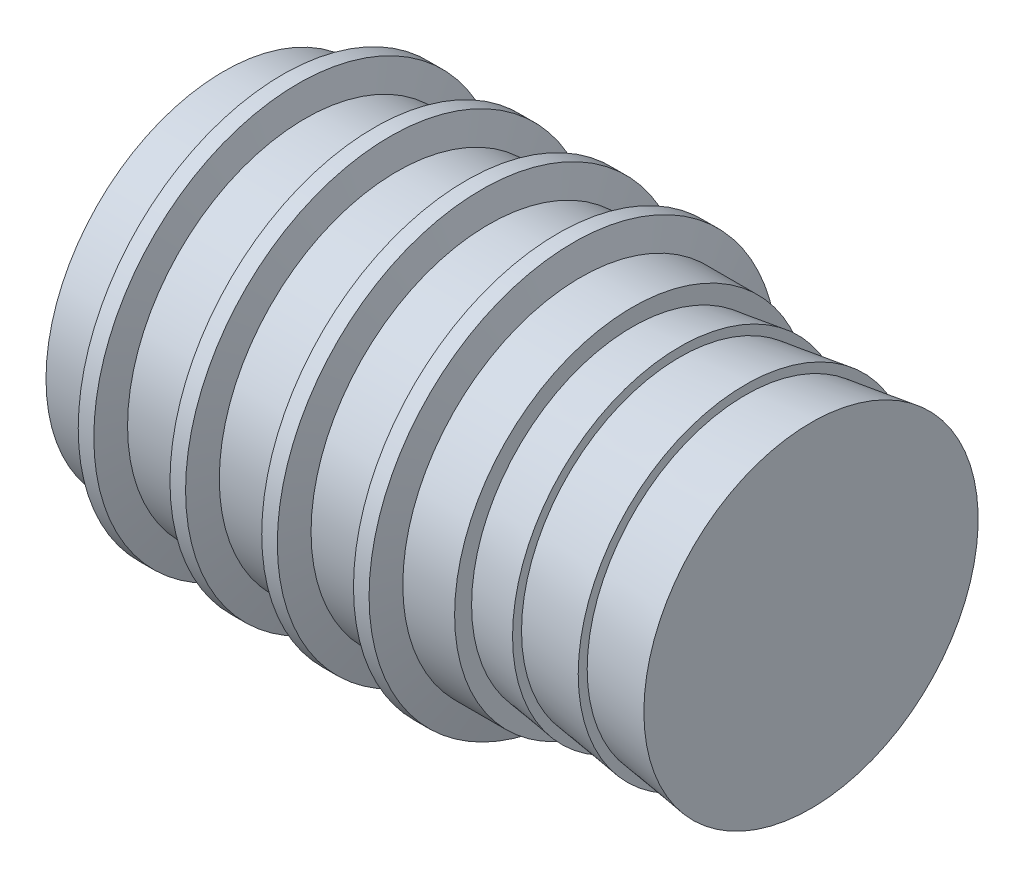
ISO-10303-21;
HEADER;
FILE_DESCRIPTION(('STEP AP214'),'2;1');
FILE_NAME('part.step','',(''),(''),'','','');
FILE_SCHEMA(('AUTOMOTIVE_DESIGN { 1 0 10303 214 1 1 1 1 }'));
ENDSEC;
DATA;
#1=APPLICATION_CONTEXT('core data for automotive mechanical design processes');
#2=APPLICATION_PROTOCOL_DEFINITION('international standard','automotive_design',2000,#1);
#3=PRODUCT_CONTEXT('',#1,'mechanical');
#4=PRODUCT('Part','Part','',(#3));
#5=PRODUCT_RELATED_PRODUCT_CATEGORY('part','',(#4));
#6=PRODUCT_DEFINITION_FORMATION('','',#4);
#7=PRODUCT_DEFINITION_CONTEXT('part definition',#1,'design');
#8=PRODUCT_DEFINITION('design','',#6,#7);
#9=PRODUCT_DEFINITION_SHAPE('','',#8);
#10=(LENGTH_UNIT() NAMED_UNIT(*) SI_UNIT(.MILLI.,.METRE.));
#11=(NAMED_UNIT(*) PLANE_ANGLE_UNIT() SI_UNIT($,.RADIAN.));
#12=(NAMED_UNIT(*) SI_UNIT($,.STERADIAN.) SOLID_ANGLE_UNIT());
#13=UNCERTAINTY_MEASURE_WITH_UNIT(LENGTH_MEASURE(1.E-05),#10,'distance_accuracy_value','');
#14=(GEOMETRIC_REPRESENTATION_CONTEXT(3) GLOBAL_UNCERTAINTY_ASSIGNED_CONTEXT((#13)) GLOBAL_UNIT_ASSIGNED_CONTEXT((#10,
#11,#12)) REPRESENTATION_CONTEXT('',''));
#15=CARTESIAN_POINT('',(0.,0.,0.));
#16=DIRECTION('',(0.,0.,1.));
#17=DIRECTION('',(1.,0.,0.));
#18=AXIS2_PLACEMENT_3D('',#15,#16,#17);
#19=CARTESIAN_POINT('',(11.5,0.,0.));
#20=DIRECTION('',(1.,0.,0.));
#21=DIRECTION('',(0.,0.,-1.));
#22=AXIS2_PLACEMENT_3D('',#19,#20,#21);
#23=PLANE('',#22);
#24=CARTESIAN_POINT('',(11.5,0.,0.));
#25=DIRECTION('',(-1.,0.,0.));
#26=DIRECTION('',(0.,0.,1.));
#27=AXIS2_PLACEMENT_3D('',#24,#25,#26);
#28=CIRCLE('',#27,3.27246991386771);
#29=CARTESIAN_POINT('',(11.5,0.,3.27246991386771));
#30=VERTEX_POINT('',#29);
#31=EDGE_CURVE('E9',#30,#30,#28,.T.);
#32=ORIENTED_EDGE('',*,*,#31,.F.);
#33=EDGE_LOOP('',(#32));
#34=FACE_BOUND('',#33,.T.);
#35=ADVANCED_FACE('F14',(#34),#23,.T.);
#36=CARTESIAN_POINT('',(10.2144174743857,0.,0.));
#37=DIRECTION('',(1.,0.,0.));
#38=DIRECTION('',(0.,0.,-1.));
#39=AXIS2_PLACEMENT_3D('',#36,#37,#38);
#40=CONICAL_SURFACE('',#39,3.09681765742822,0.135791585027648);
#41=ORIENTED_EDGE('',*,*,#31,.T.);
#42=EDGE_LOOP('',(#41));
#43=FACE_BOUND('',#42,.T.);
#44=CARTESIAN_POINT('',(10.2144174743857,0.,0.));
#45=DIRECTION('',(-1.,0.,0.));
#46=DIRECTION('',(0.,0.,1.));
#47=AXIS2_PLACEMENT_3D('',#44,#45,#46);
#48=CIRCLE('',#47,3.09681765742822);
#49=CARTESIAN_POINT('',(10.2144174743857,0.,3.09681765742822));
#50=VERTEX_POINT('',#49);
#51=EDGE_CURVE('E20',#50,#50,#48,.T.);
#52=ORIENTED_EDGE('',*,*,#51,.F.);
#53=EDGE_LOOP('',(#52));
#54=FACE_BOUND('',#53,.T.);
#55=ADVANCED_FACE('F146',(#43,#54),#40,.T.);
#56=CARTESIAN_POINT('',(10.2144174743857,0.,0.));
#57=DIRECTION('',(1.,0.,0.));
#58=DIRECTION('',(0.,0.,-1.));
#59=AXIS2_PLACEMENT_3D('',#56,#57,#58);
#60=PLANE('',#59);
#61=ORIENTED_EDGE('',*,*,#51,.T.);
#62=EDGE_LOOP('',(#61));
#63=FACE_BOUND('',#62,.T.);
#64=CARTESIAN_POINT('',(10.2144174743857,0.,0.));
#65=DIRECTION('',(-1.,0.,0.));
#66=DIRECTION('',(0.,0.,1.));
#67=AXIS2_PLACEMENT_3D('',#64,#65,#66);
#68=CIRCLE('',#67,3.27246991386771);
#69=CARTESIAN_POINT('',(10.2144174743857,0.,3.27246991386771));
#70=VERTEX_POINT('',#69);
#71=EDGE_CURVE('E24',#70,#70,#68,.T.);
#72=ORIENTED_EDGE('',*,*,#71,.F.);
#73=EDGE_LOOP('',(#72));
#74=FACE_BOUND('',#73,.T.);
#75=ADVANCED_FACE('F152',(#63,#74),#60,.T.);
#76=CARTESIAN_POINT('',(8.9288349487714,0.,0.));
#77=DIRECTION('',(1.,0.,0.));
#78=DIRECTION('',(0.,0.,-1.));
#79=AXIS2_PLACEMENT_3D('',#76,#77,#78);
#80=CONICAL_SURFACE('',#79,3.09681765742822,0.135791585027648);
#81=ORIENTED_EDGE('',*,*,#71,.T.);
#82=EDGE_LOOP('',(#81));
#83=FACE_BOUND('',#82,.T.);
#84=CARTESIAN_POINT('',(8.9288349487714,0.,0.));
#85=DIRECTION('',(-1.,0.,0.));
#86=DIRECTION('',(0.,0.,1.));
#87=AXIS2_PLACEMENT_3D('',#84,#85,#86);
#88=CIRCLE('',#87,3.09681765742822);
#89=CARTESIAN_POINT('',(8.9288349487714,0.,3.09681765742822));
#90=VERTEX_POINT('',#89);
#91=EDGE_CURVE('E28',#90,#90,#88,.T.);
#92=ORIENTED_EDGE('',*,*,#91,.F.);
#93=EDGE_LOOP('',(#92));
#94=FACE_BOUND('',#93,.T.);
#95=ADVANCED_FACE('F157',(#83,#94),#80,.T.);
#96=CARTESIAN_POINT('',(8.9288349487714,0.,0.));
#97=DIRECTION('',(1.,0.,0.));
#98=DIRECTION('',(0.,0.,-1.));
#99=AXIS2_PLACEMENT_3D('',#96,#97,#98);
#100=PLANE('',#99);
#101=ORIENTED_EDGE('',*,*,#91,.T.);
#102=EDGE_LOOP('',(#101));
#103=FACE_BOUND('',#102,.T.);
#104=CARTESIAN_POINT('',(8.9288349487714,0.,0.));
#105=DIRECTION('',(-1.,0.,0.));
#106=DIRECTION('',(0.,0.,1.));
#107=AXIS2_PLACEMENT_3D('',#104,#105,#106);
#108=CIRCLE('',#107,3.27246991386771);
#109=CARTESIAN_POINT('',(8.9288349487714,0.,3.27246991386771));
#110=VERTEX_POINT('',#109);
#111=EDGE_CURVE('E33',#110,#110,#108,.T.);
#112=ORIENTED_EDGE('',*,*,#111,.F.);
#113=EDGE_LOOP('',(#112));
#114=FACE_BOUND('',#113,.T.);
#115=ADVANCED_FACE('F163',(#103,#114),#100,.T.);
#116=CARTESIAN_POINT('',(8.,0.,0.));
#117=DIRECTION('',(1.,0.,0.));
#118=DIRECTION('',(0.,0.,-1.));
#119=AXIS2_PLACEMENT_3D('',#116,#117,#118);
#120=CONICAL_SURFACE('',#119,3.14556094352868,0.135791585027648);
#121=ORIENTED_EDGE('',*,*,#111,.T.);
#122=EDGE_LOOP('',(#121));
#123=FACE_BOUND('',#122,.T.);
#124=CARTESIAN_POINT('',(8.,0.,0.));
#125=DIRECTION('',(-1.,0.,0.));
#126=DIRECTION('',(0.,0.,1.));
#127=AXIS2_PLACEMENT_3D('',#124,#125,#126);
#128=CIRCLE('',#127,3.14556094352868);
#129=CARTESIAN_POINT('',(8.,0.,3.14556094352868));
#130=VERTEX_POINT('',#129);
#131=EDGE_CURVE('E36',#130,#130,#128,.T.);
#132=ORIENTED_EDGE('',*,*,#131,.F.);
#133=EDGE_LOOP('',(#132));
#134=FACE_BOUND('',#133,.T.);
#135=ADVANCED_FACE('F167',(#123,#134),#120,.T.);
#136=CARTESIAN_POINT('',(8.,0.,0.));
#137=DIRECTION('',(1.,0.,0.));
#138=DIRECTION('',(0.,0.,-1.));
#139=AXIS2_PLACEMENT_3D('',#136,#137,#138);
#140=PLANE('',#139);
#141=ORIENTED_EDGE('',*,*,#131,.T.);
#142=EDGE_LOOP('',(#141));
#143=FACE_BOUND('',#142,.T.);
#144=CARTESIAN_POINT('',(8.,0.,0.));
#145=DIRECTION('',(-1.,0.,0.));
#146=DIRECTION('',(0.,0.,1.));
#147=AXIS2_PLACEMENT_3D('',#144,#145,#146);
#148=CIRCLE('',#147,3.47805597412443);
#149=CARTESIAN_POINT('',(8.,0.,3.47805597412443));
#150=VERTEX_POINT('',#149);
#151=EDGE_CURVE('E39',#150,#150,#148,.T.);
#152=ORIENTED_EDGE('',*,*,#151,.F.);
#153=EDGE_LOOP('',(#152));
#154=FACE_BOUND('',#153,.T.);
#155=ADVANCED_FACE('F171',(#143,#154),#140,.T.);
#156=CARTESIAN_POINT('',(0.,0.,0.));
#157=DIRECTION('',(-1.,0.,0.));
#158=DIRECTION('',(0.,0.,1.));
#159=AXIS2_PLACEMENT_3D('',#156,#157,#158);
#160=CYLINDRICAL_SURFACE('',#159,3.47805597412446);
#161=CARTESIAN_POINT('',(6.9857611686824,0.,0.));
#162=DIRECTION('',(-1.,0.,0.));
#163=DIRECTION('',(0.,0.,1.));
#164=AXIS2_PLACEMENT_3D('',#161,#162,#163);
#165=CIRCLE('',#164,3.4780559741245);
#166=CARTESIAN_POINT('',(6.9857611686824,0.,3.4780559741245));
#167=VERTEX_POINT('',#166);
#168=EDGE_CURVE('E42',#167,#167,#165,.T.);
#169=ORIENTED_EDGE('',*,*,#168,.F.);
#170=EDGE_LOOP('',(#169));
#171=FACE_BOUND('',#170,.T.);
#172=ORIENTED_EDGE('',*,*,#151,.T.);
#173=EDGE_LOOP('',(#172));
#174=FACE_BOUND('',#173,.T.);
#175=ADVANCED_FACE('F175',(#171,#174),#160,.T.);
#176=CARTESIAN_POINT('',(6.9857611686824,0.,0.));
#177=DIRECTION('',(-1.,0.,0.));
#178=DIRECTION('',(0.,0.,1.));
#179=AXIS2_PLACEMENT_3D('',#176,#177,#178);
#180=CONICAL_SURFACE('',#179,3.4780559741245,1.31131426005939);
#181=CARTESIAN_POINT('',(6.84720223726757,0.,0.));
#182=DIRECTION('',(-1.,0.,0.));
#183=DIRECTION('',(0.,0.,1.));
#184=AXIS2_PLACEMENT_3D('',#181,#182,#183);
#185=CIRCLE('',#184,4.00000000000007);
#186=CARTESIAN_POINT('',(6.84720223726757,0.,4.00000000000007));
#187=VERTEX_POINT('',#186);
#188=EDGE_CURVE('E45',#187,#187,#185,.T.);
#189=ORIENTED_EDGE('',*,*,#188,.F.);
#190=EDGE_LOOP('',(#189));
#191=FACE_BOUND('',#190,.T.);
#192=ORIENTED_EDGE('',*,*,#168,.T.);
#193=EDGE_LOOP('',(#192));
#194=FACE_BOUND('',#193,.T.);
#195=ADVANCED_FACE('F179',(#191,#194),#180,.T.);
#196=CARTESIAN_POINT('',(0.,0.,0.));
#197=DIRECTION('',(-1.,0.,0.));
#198=DIRECTION('',(0.,0.,1.));
#199=AXIS2_PLACEMENT_3D('',#196,#197,#198);
#200=CYLINDRICAL_SURFACE('',#199,4.00000000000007);
#201=ORIENTED_EDGE('',*,*,#188,.T.);
#202=EDGE_LOOP('',(#201));
#203=FACE_BOUND('',#202,.T.);
#204=CARTESIAN_POINT('',(6.54182407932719,0.,0.));
#205=DIRECTION('',(-1.,0.,0.));
#206=DIRECTION('',(0.,0.,1.));
#207=AXIS2_PLACEMENT_3D('',#204,#205,#206);
#208=CIRCLE('',#207,4.00000000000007);
#209=CARTESIAN_POINT('',(6.54182407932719,0.,4.00000000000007));
#210=VERTEX_POINT('',#209);
#211=EDGE_CURVE('E48',#210,#210,#208,.T.);
#212=ORIENTED_EDGE('',*,*,#211,.F.);
#213=EDGE_LOOP('',(#212));
#214=FACE_BOUND('',#213,.T.);
#215=ADVANCED_FACE('F183',(#203,#214),#200,.T.);
#216=CARTESIAN_POINT('',(6.40326514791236,0.,0.));
#217=DIRECTION('',(1.,0.,0.));
#218=DIRECTION('',(0.,0.,-1.));
#219=AXIS2_PLACEMENT_3D('',#216,#217,#218);
#220=CONICAL_SURFACE('',#219,3.4780559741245,1.31131426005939);
#221=ORIENTED_EDGE('',*,*,#211,.T.);
#222=EDGE_LOOP('',(#221));
#223=FACE_BOUND('',#222,.T.);
#224=CARTESIAN_POINT('',(6.40326514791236,0.,0.));
#225=DIRECTION('',(-1.,0.,0.));
#226=DIRECTION('',(0.,0.,1.));
#227=AXIS2_PLACEMENT_3D('',#224,#225,#226);
#228=CIRCLE('',#227,3.4780559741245);
#229=CARTESIAN_POINT('',(6.40326514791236,0.,3.4780559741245));
#230=VERTEX_POINT('',#229);
#231=EDGE_CURVE('E51',#230,#230,#228,.T.);
#232=ORIENTED_EDGE('',*,*,#231,.F.);
#233=EDGE_LOOP('',(#232));
#234=FACE_BOUND('',#233,.T.);
#235=ADVANCED_FACE('F187',(#223,#234),#220,.T.);
#236=CARTESIAN_POINT('',(0.,0.,0.));
#237=DIRECTION('',(-1.,0.,0.));
#238=DIRECTION('',(0.,0.,1.));
#239=AXIS2_PLACEMENT_3D('',#236,#237,#238);
#240=CYLINDRICAL_SURFACE('',#239,3.47805597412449);
#241=CARTESIAN_POINT('',(5.18941906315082,0.,0.));
#242=DIRECTION('',(-1.,0.,0.));
#243=DIRECTION('',(0.,0.,1.));
#244=AXIS2_PLACEMENT_3D('',#241,#242,#243);
#245=CIRCLE('',#244,3.47805597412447);
#246=CARTESIAN_POINT('',(5.18941906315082,0.,3.47805597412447));
#247=VERTEX_POINT('',#246);
#248=EDGE_CURVE('E54',#247,#247,#245,.T.);
#249=ORIENTED_EDGE('',*,*,#248,.F.);
#250=EDGE_LOOP('',(#249));
#251=FACE_BOUND('',#250,.T.);
#252=ORIENTED_EDGE('',*,*,#231,.T.);
#253=EDGE_LOOP('',(#252));
#254=FACE_BOUND('',#253,.T.);
#255=ADVANCED_FACE('F191',(#251,#254),#240,.T.);
#256=CARTESIAN_POINT('',(5.18941906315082,0.,0.));
#257=DIRECTION('',(-1.,0.,0.));
#258=DIRECTION('',(0.,0.,1.));
#259=AXIS2_PLACEMENT_3D('',#256,#257,#258);
#260=CONICAL_SURFACE('',#259,3.47805597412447,1.31131426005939);
#261=CARTESIAN_POINT('',(5.05086013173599,0.,0.));
#262=DIRECTION('',(-1.,0.,0.));
#263=DIRECTION('',(0.,0.,1.));
#264=AXIS2_PLACEMENT_3D('',#261,#262,#263);
#265=CIRCLE('',#264,4.00000000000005);
#266=CARTESIAN_POINT('',(5.05086013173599,0.,4.00000000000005));
#267=VERTEX_POINT('',#266);
#268=EDGE_CURVE('E57',#267,#267,#265,.T.);
#269=ORIENTED_EDGE('',*,*,#268,.F.);
#270=EDGE_LOOP('',(#269));
#271=FACE_BOUND('',#270,.T.);
#272=ORIENTED_EDGE('',*,*,#248,.T.);
#273=EDGE_LOOP('',(#272));
#274=FACE_BOUND('',#273,.T.);
#275=ADVANCED_FACE('F195',(#271,#274),#260,.T.);
#276=CARTESIAN_POINT('',(0.,0.,0.));
#277=DIRECTION('',(-1.,0.,0.));
#278=DIRECTION('',(0.,0.,1.));
#279=AXIS2_PLACEMENT_3D('',#276,#277,#278);
#280=CYLINDRICAL_SURFACE('',#279,4.00000000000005);
#281=ORIENTED_EDGE('',*,*,#268,.T.);
#282=EDGE_LOOP('',(#281));
#283=FACE_BOUND('',#282,.T.);
#284=CARTESIAN_POINT('',(4.74548197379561,0.,0.));
#285=DIRECTION('',(-1.,0.,0.));
#286=DIRECTION('',(0.,0.,1.));
#287=AXIS2_PLACEMENT_3D('',#284,#285,#286);
#288=CIRCLE('',#287,4.00000000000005);
#289=CARTESIAN_POINT('',(4.74548197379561,0.,4.00000000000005));
#290=VERTEX_POINT('',#289);
#291=EDGE_CURVE('E60',#290,#290,#288,.T.);
#292=ORIENTED_EDGE('',*,*,#291,.F.);
#293=EDGE_LOOP('',(#292));
#294=FACE_BOUND('',#293,.T.);
#295=ADVANCED_FACE('F199',(#283,#294),#280,.T.);
#296=CARTESIAN_POINT('',(4.60692304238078,0.,0.));
#297=DIRECTION('',(1.,0.,0.));
#298=DIRECTION('',(0.,0.,-1.));
#299=AXIS2_PLACEMENT_3D('',#296,#297,#298);
#300=CONICAL_SURFACE('',#299,3.47805597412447,1.31131426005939);
#301=ORIENTED_EDGE('',*,*,#291,.T.);
#302=EDGE_LOOP('',(#301));
#303=FACE_BOUND('',#302,.T.);
#304=CARTESIAN_POINT('',(4.60692304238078,0.,0.));
#305=DIRECTION('',(-1.,0.,0.));
#306=DIRECTION('',(0.,0.,1.));
#307=AXIS2_PLACEMENT_3D('',#304,#305,#306);
#308=CIRCLE('',#307,3.47805597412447);
#309=CARTESIAN_POINT('',(4.60692304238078,0.,3.47805597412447));
#310=VERTEX_POINT('',#309);
#311=EDGE_CURVE('E63',#310,#310,#308,.T.);
#312=ORIENTED_EDGE('',*,*,#311,.F.);
#313=EDGE_LOOP('',(#312));
#314=FACE_BOUND('',#313,.T.);
#315=ADVANCED_FACE('F203',(#303,#314),#300,.T.);
#316=CARTESIAN_POINT('',(0.,0.,0.));
#317=DIRECTION('',(-1.,0.,0.));
#318=DIRECTION('',(0.,0.,1.));
#319=AXIS2_PLACEMENT_3D('',#316,#317,#318);
#320=CYLINDRICAL_SURFACE('',#319,3.47805597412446);
#321=CARTESIAN_POINT('',(3.39307695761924,0.,0.));
#322=DIRECTION('',(-1.,0.,0.));
#323=DIRECTION('',(0.,0.,1.));
#324=AXIS2_PLACEMENT_3D('',#321,#322,#323);
#325=CIRCLE('',#324,3.47805597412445);
#326=CARTESIAN_POINT('',(3.39307695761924,0.,3.47805597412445));
#327=VERTEX_POINT('',#326);
#328=EDGE_CURVE('E66',#327,#327,#325,.T.);
#329=ORIENTED_EDGE('',*,*,#328,.F.);
#330=EDGE_LOOP('',(#329));
#331=FACE_BOUND('',#330,.T.);
#332=ORIENTED_EDGE('',*,*,#311,.T.);
#333=EDGE_LOOP('',(#332));
#334=FACE_BOUND('',#333,.T.);
#335=ADVANCED_FACE('F207',(#331,#334),#320,.T.);
#336=CARTESIAN_POINT('',(3.39307695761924,0.,0.));
#337=DIRECTION('',(-1.,0.,0.));
#338=DIRECTION('',(0.,0.,1.));
#339=AXIS2_PLACEMENT_3D('',#336,#337,#338);
#340=CONICAL_SURFACE('',#339,3.47805597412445,1.31131426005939);
#341=CARTESIAN_POINT('',(3.2545180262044,0.,0.));
#342=DIRECTION('',(-1.,0.,0.));
#343=DIRECTION('',(0.,0.,1.));
#344=AXIS2_PLACEMENT_3D('',#341,#342,#343);
#345=CIRCLE('',#344,4.);
#346=CARTESIAN_POINT('',(3.2545180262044,0.,4.));
#347=VERTEX_POINT('',#346);
#348=EDGE_CURVE('E69',#347,#347,#345,.T.);
#349=ORIENTED_EDGE('',*,*,#348,.F.);
#350=EDGE_LOOP('',(#349));
#351=FACE_BOUND('',#350,.T.);
#352=ORIENTED_EDGE('',*,*,#328,.T.);
#353=EDGE_LOOP('',(#352));
#354=FACE_BOUND('',#353,.T.);
#355=ADVANCED_FACE('F211',(#351,#354),#340,.T.);
#356=CARTESIAN_POINT('',(0.,0.,0.));
#357=DIRECTION('',(-1.,0.,0.));
#358=DIRECTION('',(0.,0.,1.));
#359=AXIS2_PLACEMENT_3D('',#356,#357,#358);
#360=CYLINDRICAL_SURFACE('',#359,4.);
#361=ORIENTED_EDGE('',*,*,#348,.T.);
#362=EDGE_LOOP('',(#361));
#363=FACE_BOUND('',#362,.T.);
#364=CARTESIAN_POINT('',(2.94913986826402,0.,0.));
#365=DIRECTION('',(-1.,0.,0.));
#366=DIRECTION('',(0.,0.,1.));
#367=AXIS2_PLACEMENT_3D('',#364,#365,#366);
#368=CIRCLE('',#367,4.);
#369=CARTESIAN_POINT('',(2.94913986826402,0.,4.));
#370=VERTEX_POINT('',#369);
#371=EDGE_CURVE('E72',#370,#370,#368,.T.);
#372=ORIENTED_EDGE('',*,*,#371,.F.);
#373=EDGE_LOOP('',(#372));
#374=FACE_BOUND('',#373,.T.);
#375=ADVANCED_FACE('F215',(#363,#374),#360,.T.);
#376=CARTESIAN_POINT('',(2.8105809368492,0.,0.));
#377=DIRECTION('',(1.,0.,0.));
#378=DIRECTION('',(0.,0.,-1.));
#379=AXIS2_PLACEMENT_3D('',#376,#377,#378);
#380=CONICAL_SURFACE('',#379,3.47805597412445,1.31131426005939);
#381=ORIENTED_EDGE('',*,*,#371,.T.);
#382=EDGE_LOOP('',(#381));
#383=FACE_BOUND('',#382,.T.);
#384=CARTESIAN_POINT('',(2.8105809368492,0.,0.));
#385=DIRECTION('',(-1.,0.,0.));
#386=DIRECTION('',(0.,0.,1.));
#387=AXIS2_PLACEMENT_3D('',#384,#385,#386);
#388=CIRCLE('',#387,3.47805597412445);
#389=CARTESIAN_POINT('',(2.8105809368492,0.,3.47805597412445));
#390=VERTEX_POINT('',#389);
#391=EDGE_CURVE('E75',#390,#390,#388,.T.);
#392=ORIENTED_EDGE('',*,*,#391,.F.);
#393=EDGE_LOOP('',(#392));
#394=FACE_BOUND('',#393,.T.);
#395=ADVANCED_FACE('F219',(#383,#394),#380,.T.);
#396=CARTESIAN_POINT('',(0.,0.,0.));
#397=DIRECTION('',(-1.,0.,0.));
#398=DIRECTION('',(0.,0.,1.));
#399=AXIS2_PLACEMENT_3D('',#396,#397,#398);
#400=CYLINDRICAL_SURFACE('',#399,3.47805597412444);
#401=CARTESIAN_POINT('',(1.59673485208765,0.,0.));
#402=DIRECTION('',(-1.,0.,0.));
#403=DIRECTION('',(0.,0.,1.));
#404=AXIS2_PLACEMENT_3D('',#401,#402,#403);
#405=CIRCLE('',#404,3.47805597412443);
#406=CARTESIAN_POINT('',(1.59673485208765,0.,3.47805597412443));
#407=VERTEX_POINT('',#406);
#408=EDGE_CURVE('E78',#407,#407,#405,.T.);
#409=ORIENTED_EDGE('',*,*,#408,.F.);
#410=EDGE_LOOP('',(#409));
#411=FACE_BOUND('',#410,.T.);
#412=ORIENTED_EDGE('',*,*,#391,.T.);
#413=EDGE_LOOP('',(#412));
#414=FACE_BOUND('',#413,.T.);
#415=ADVANCED_FACE('F223',(#411,#414),#400,.T.);
#416=CARTESIAN_POINT('',(1.59673485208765,0.,0.));
#417=DIRECTION('',(-1.,0.,0.));
#418=DIRECTION('',(0.,0.,1.));
#419=AXIS2_PLACEMENT_3D('',#416,#417,#418);
#420=CONICAL_SURFACE('',#419,3.47805597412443,1.31131426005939);
#421=CARTESIAN_POINT('',(1.45817592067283,0.,0.));
#422=DIRECTION('',(-1.,0.,0.));
#423=DIRECTION('',(0.,0.,1.));
#424=AXIS2_PLACEMENT_3D('',#421,#422,#423);
#425=CIRCLE('',#424,4.);
#426=CARTESIAN_POINT('',(1.45817592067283,0.,4.));
#427=VERTEX_POINT('',#426);
#428=EDGE_CURVE('E81',#427,#427,#425,.T.);
#429=ORIENTED_EDGE('',*,*,#428,.F.);
#430=EDGE_LOOP('',(#429));
#431=FACE_BOUND('',#430,.T.);
#432=ORIENTED_EDGE('',*,*,#408,.T.);
#433=EDGE_LOOP('',(#432));
#434=FACE_BOUND('',#433,.T.);
#435=ADVANCED_FACE('F227',(#431,#434),#420,.T.);
#436=CARTESIAN_POINT('',(0.,0.,0.));
#437=DIRECTION('',(-1.,0.,0.));
#438=DIRECTION('',(0.,0.,1.));
#439=AXIS2_PLACEMENT_3D('',#436,#437,#438);
#440=CYLINDRICAL_SURFACE('',#439,4.);
#441=ORIENTED_EDGE('',*,*,#428,.T.);
#442=EDGE_LOOP('',(#441));
#443=FACE_BOUND('',#442,.T.);
#444=CARTESIAN_POINT('',(1.15279776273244,0.,0.));
#445=DIRECTION('',(-1.,0.,0.));
#446=DIRECTION('',(0.,0.,1.));
#447=AXIS2_PLACEMENT_3D('',#444,#445,#446);
#448=CIRCLE('',#447,4.);
#449=CARTESIAN_POINT('',(1.15279776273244,0.,4.));
#450=VERTEX_POINT('',#449);
#451=EDGE_CURVE('E84',#450,#450,#448,.T.);
#452=ORIENTED_EDGE('',*,*,#451,.F.);
#453=EDGE_LOOP('',(#452));
#454=FACE_BOUND('',#453,.T.);
#455=ADVANCED_FACE('F142',(#443,#454),#440,.T.);
#456=CARTESIAN_POINT('',(1.01423883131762,0.,0.));
#457=DIRECTION('',(1.,0.,0.));
#458=DIRECTION('',(0.,0.,-1.));
#459=AXIS2_PLACEMENT_3D('',#456,#457,#458);
#460=CONICAL_SURFACE('',#459,3.47805597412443,1.31131426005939);
#461=ORIENTED_EDGE('',*,*,#451,.T.);
#462=EDGE_LOOP('',(#461));
#463=FACE_BOUND('',#462,.T.);
#464=CARTESIAN_POINT('',(1.01423883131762,0.,0.));
#465=DIRECTION('',(-1.,0.,0.));
#466=DIRECTION('',(0.,0.,1.));
#467=AXIS2_PLACEMENT_3D('',#464,#465,#466);
#468=CIRCLE('',#467,3.47805597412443);
#469=CARTESIAN_POINT('',(1.01423883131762,0.,3.47805597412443));
#470=VERTEX_POINT('',#469);
#471=EDGE_CURVE('E87',#470,#470,#468,.T.);
#472=ORIENTED_EDGE('',*,*,#471,.F.);
#473=EDGE_LOOP('',(#472));
#474=FACE_BOUND('',#473,.T.);
#475=ADVANCED_FACE('F134',(#463,#474),#460,.T.);
#476=CARTESIAN_POINT('',(0.,0.,0.));
#477=DIRECTION('',(-1.,0.,0.));
#478=DIRECTION('',(0.,0.,1.));
#479=AXIS2_PLACEMENT_3D('',#476,#477,#478);
#480=CYLINDRICAL_SURFACE('',#479,3.47805597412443);
#481=ORIENTED_EDGE('',*,*,#471,.T.);
#482=EDGE_LOOP('',(#481));
#483=FACE_BOUND('',#482,.T.);
#484=CARTESIAN_POINT('',(0.,0.,0.));
#485=DIRECTION('',(-1.,0.,0.));
#486=DIRECTION('',(0.,0.,1.));
#487=AXIS2_PLACEMENT_3D('',#484,#485,#486);
#488=CIRCLE('',#487,3.47805597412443);
#489=CARTESIAN_POINT('',(0.,0.,3.47805597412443));
#490=VERTEX_POINT('',#489);
#491=EDGE_CURVE('E90',#490,#490,#488,.T.);
#492=ORIENTED_EDGE('',*,*,#491,.F.);
#493=EDGE_LOOP('',(#492));
#494=FACE_BOUND('',#493,.T.);
#495=ADVANCED_FACE('F129',(#483,#494),#480,.T.);
#496=CARTESIAN_POINT('',(0.,0.,0.));
#497=DIRECTION('',(-1.,0.,0.));
#498=DIRECTION('',(0.,0.,1.));
#499=AXIS2_PLACEMENT_3D('',#496,#497,#498);
#500=PLANE('',#499);
#501=CARTESIAN_POINT('',(0.,0.,0.));
#502=DIRECTION('',(-1.,0.,0.));
#503=DIRECTION('',(0.,0.,1.));
#504=AXIS2_PLACEMENT_3D('',#501,#502,#503);
#505=CIRCLE('',#504,3.);
#506=CARTESIAN_POINT('',(0.,0.,3.));
#507=VERTEX_POINT('',#506);
#508=EDGE_CURVE('E96',#507,#507,#505,.T.);
#509=ORIENTED_EDGE('',*,*,#508,.F.);
#510=EDGE_LOOP('',(#509));
#511=FACE_BOUND('',#510,.T.);
#512=ORIENTED_EDGE('',*,*,#491,.T.);
#513=EDGE_LOOP('',(#512));
#514=FACE_BOUND('',#513,.T.);
#515=ADVANCED_FACE('F123',(#511,#514),#500,.T.);
#516=CARTESIAN_POINT('',(0.,0.,0.));
#517=DIRECTION('',(-1.,0.,0.));
#518=DIRECTION('',(0.,0.,1.));
#519=AXIS2_PLACEMENT_3D('',#516,#517,#518);
#520=CONICAL_SURFACE('',#519,3.,0.0349065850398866);
#521=CARTESIAN_POINT('',(2.,0.,0.));
#522=DIRECTION('',(-1.,0.,0.));
#523=DIRECTION('',(0.,0.,1.));
#524=AXIS2_PLACEMENT_3D('',#521,#522,#523);
#525=CIRCLE('',#524,2.93015846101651);
#526=CARTESIAN_POINT('',(2.,0.,2.93015846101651));
#527=VERTEX_POINT('',#526);
#528=EDGE_CURVE('E93',#527,#527,#525,.T.);
#529=ORIENTED_EDGE('',*,*,#528,.F.);
#530=EDGE_LOOP('',(#529));
#531=FACE_BOUND('',#530,.T.);
#532=ORIENTED_EDGE('',*,*,#508,.T.);
#533=EDGE_LOOP('',(#532));
#534=FACE_BOUND('',#533,.T.);
#535=ADVANCED_FACE('F117',(#531,#534),#520,.F.);
#536=CARTESIAN_POINT('',(2.,0.,0.));
#537=DIRECTION('',(-1.,0.,0.));
#538=DIRECTION('',(0.,0.,1.));
#539=AXIS2_PLACEMENT_3D('',#536,#537,#538);
#540=PLANE('',#539);
#541=CARTESIAN_POINT('',(2.,0.,0.));
#542=DIRECTION('',(-1.,0.,0.));
#543=DIRECTION('',(0.,0.,1.));
#544=AXIS2_PLACEMENT_3D('',#541,#542,#543);
#545=CIRCLE('',#544,2.);
#546=CARTESIAN_POINT('',(2.,0.,2.));
#547=VERTEX_POINT('',#546);
#548=EDGE_CURVE('E100',#547,#547,#545,.T.);
#549=ORIENTED_EDGE('',*,*,#548,.F.);
#550=EDGE_LOOP('',(#549));
#551=FACE_BOUND('',#550,.T.);
#552=ORIENTED_EDGE('',*,*,#528,.T.);
#553=EDGE_LOOP('',(#552));
#554=FACE_BOUND('',#553,.T.);
#555=ADVANCED_FACE('F111',(#551,#554),#540,.T.);
#556=CARTESIAN_POINT('',(6.,0.,0.));
#557=DIRECTION('',(-1.,0.,0.));
#558=DIRECTION('',(0.,0.,1.));
#559=AXIS2_PLACEMENT_3D('',#556,#557,#558);
#560=CYLINDRICAL_SURFACE('',#559,2.);
#561=CARTESIAN_POINT('',(6.,0.,0.));
#562=DIRECTION('',(-1.,0.,0.));
#563=DIRECTION('',(0.,0.,1.));
#564=AXIS2_PLACEMENT_3D('',#561,#562,#563);
#565=CIRCLE('',#564,2.);
#566=CARTESIAN_POINT('',(6.,0.,2.));
#567=VERTEX_POINT('',#566);
#568=EDGE_CURVE('E99',#567,#567,#565,.T.);
#569=ORIENTED_EDGE('',*,*,#568,.F.);
#570=EDGE_LOOP('',(#569));
#571=FACE_BOUND('',#570,.T.);
#572=ORIENTED_EDGE('',*,*,#548,.T.);
#573=EDGE_LOOP('',(#572));
#574=FACE_BOUND('',#573,.T.);
#575=ADVANCED_FACE('F108',(#571,#574),#560,.F.);
#576=CARTESIAN_POINT('',(6.,0.,0.));
#577=DIRECTION('',(-1.,0.,0.));
#578=DIRECTION('',(0.,0.,1.));
#579=AXIS2_PLACEMENT_3D('',#576,#577,#578);
#580=PLANE('',#579);
#581=ORIENTED_EDGE('',*,*,#568,.T.);
#582=EDGE_LOOP('',(#581));
#583=FACE_BOUND('',#582,.T.);
#584=ADVANCED_FACE('F106',(#583),#580,.T.);
#585=CLOSED_SHELL('',(#35,#55,#75,#95,#115,#135,#155,#175,#195,#215,#235,#255,#275,#295,#315,
#335,#355,#375,#395,#415,#435,#455,#475,#495,#515,#535,#555,#575,#584));
#586=MANIFOLD_SOLID_BREP('B1',#585);
#587=ADVANCED_BREP_SHAPE_REPRESENTATION('',(#18,#586),#14);
#588=SHAPE_DEFINITION_REPRESENTATION(#9,#587);
ENDSEC;
END-ISO-10303-21;
